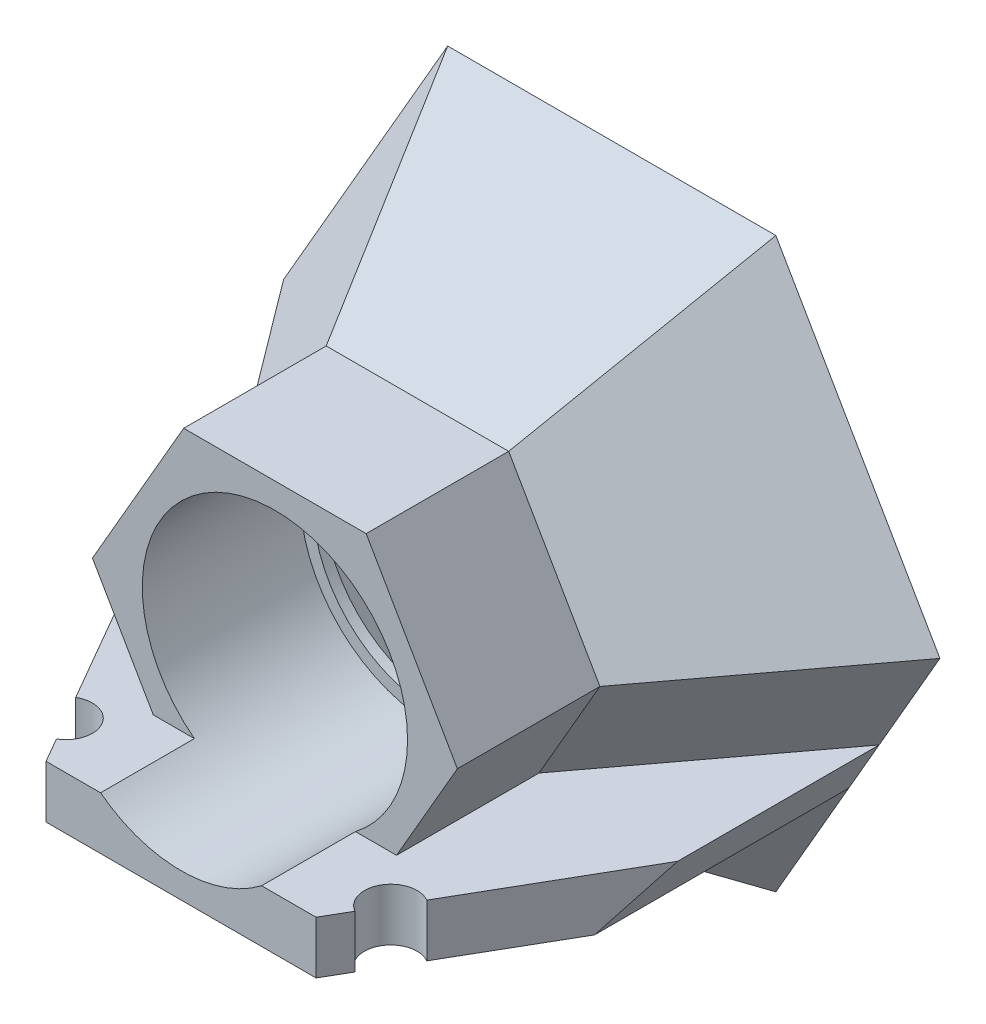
from build123d import *

# Parameters (mm, degrees)
EXTRUSION1_DEPTH             = 10
EXTRUSION1_TAPER             = 33
COQUE1_T                     = -2
ESQUISSE3_R                  = 6.3
ENL_V_MAT_EXTRU_1_DEPTH      = 1.5
ESQUISSE4_R                  = 5.7
ENL_V_MAT_EXTRU_2_DEPTH      = 23.304708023
ESQUISSE5_R                  = 6.3
EXTRUSION2_DEPTH             = 6
EXTRUSION2_DIRECTION_2_REACH = 24.918
CONG_1_R                     = 2.5
EXTRUSION3_REACH             = 28.101
EXTRUSION4_DEPTH             = 5
EXTRUSION4_DEPTH_BACK        = 6.769932
ENL_V_MAT_EXTRU_4_DEPTH      = 10
ESQUISSE10_W                 = 23.913300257
ESQUISSE10_H                 = 0.542651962
ENL_V_MAT_EXTRU_5_DEPTH      = 10
ESQUISSE12_R                 = 1.25
ENL_V_MAT_EXTRU_6_DEPTH      = 10
ENL_V_MAT_EXTRU_7_DEPTH      = 10
ENL_V_MAT_EXTRU_8_DEPTH      = 10


with BuildPart() as part:
    # Esquisse1 → Extrusion1 (new body)
    with BuildSketch(Plane.XY):
        Polygon((7.794228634, 13.5), (-7.794228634, 13.5), (-15.588457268, 0), (-7.794228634, -13.5), (7.794228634, -13.5), (15.588457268, 0), align=None)
    extrude(amount=EXTRUSION1_DEPTH, taper=EXTRUSION1_TAPER)

    # Coque1
    coque1_openings = [part.faces().sort_by_distance(p)[0] for p in [
        (0, 0, 0),
    ]]
    offset(amount=COQUE1_T, openings=coque1_openings, kind=Kind.INTERSECTION)

    # Esquisse3 → Enl_v. mat.-Extru.1 (cut)
    with BuildSketch(Plane.XY.offset(10)):
        Circle(ESQUISSE3_R)
    extrude(amount=-ENL_V_MAT_EXTRU_1_DEPTH, mode=Mode.SUBTRACT)

    # Esquisse4 → Enl_v. mat.-Extru.2 (cut, through all)
    with BuildSketch(Plane.XY.offset(8.5)):
        Circle(ESQUISSE4_R)
    extrude(amount=-ENL_V_MAT_EXTRU_2_DEPTH, mode=Mode.SUBTRACT)

    # Esquisse5 → Extrusion2 (add)
    with BuildSketch(Plane.XY.offset(10)):
        Polygon((8.667094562, 0), (4.333547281, 7.505924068), (-4.333547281, 7.505924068), (-8.667094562, 0), (-4.333547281, -7.505924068), (4.333547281, -7.505924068), align=None)
        Circle(ESQUISSE5_R, mode=Mode.SUBTRACT)
    extrude(amount=EXTRUSION2_DEPTH)

    # Esquisse5 → Extrusion2 direction 2 (add, up to next)
    with BuildSketch(Plane.XY.offset(10), mode=Mode.PRIVATE) as extrusion2_direction_2_sk1:
        Polygon((8.667094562, 0), (4.333547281, 7.505924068), (-4.333547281, 7.505924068), (-8.667094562, 0), (-4.333547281, -7.505924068), (4.333547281, -7.505924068), align=None)
        Circle(ESQUISSE5_R, mode=Mode.SUBTRACT)
    extrusion2_direction_2_tool1 = extrude(extrusion2_direction_2_sk1.sketch, amount=-EXTRUSION2_DIRECTION_2_REACH, mode=Mode.PRIVATE) - part.part
    add(extrusion2_direction_2_tool1.solids().sort_by_distance((6.301733, 3.638307, 10))[0])

    # Cong_1
    cong_1_edges = [part.edges().sort_by_distance(p)[0] for p in [
        (9.626109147, 5.557636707, 0),
        (0, 11.115273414, 0),
        (-9.626109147, 5.557636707, 0),
        (-9.626109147, -5.557636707, 0),
        (0, -11.115273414, 0),
        (9.626109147, -5.557636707, 0),
    ]]
    fillet(cong_1_edges, radius=CONG_1_R)

    # Esquisse6 → Extrusion3 (add, up to next)
    with BuildSketch(Plane.XY.offset(16), mode=Mode.PRIVATE) as extrusion3_sk1:
        Polygon((4.333547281, -7.505924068), (11.254909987, -7.505924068), (12.69828566, -5.005924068), (5.776922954, -5.005924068), align=None)
    extrusion3_tool1 = extrude(extrusion3_sk1.sketch, amount=-EXTRUSION3_REACH, mode=Mode.PRIVATE) - part.part
    # Esquisse6 → Extrusion3 (add, up to next)
    with BuildSketch(Plane.XY.offset(16), mode=Mode.PRIVATE) as extrusion3_sk2:
        Polygon((-5.776922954, -5.005924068), (-4.333547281, -7.505924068), (-11.254909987, -7.505924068), (-12.69828566, -5.005924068), align=None)
    extrusion3_tool2 = extrude(extrusion3_sk2.sketch, amount=-EXTRUSION3_REACH, mode=Mode.PRIVATE) - part.part
    add(extrusion3_tool1.solids().sort_by_distance((8.515916, -6.255924, 16))[0])
    add(extrusion3_tool2.solids().sort_by_distance((-8.515916, -6.255924, 16))[0])

    # Esquisse7 → Extrusion4 (add, two sides: drawn at the far end of the back side and taken through both)
    with BuildSketch(Plane.XY.offset(16).offset(-EXTRUSION4_DEPTH_BACK)):
        with BuildLine():
            Line((17.5, -5.005924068), (3.825012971, -5.005924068))
            ThreePointArc((3.825012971, -5.005924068), (0, -6.3), (-3.825012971, -5.005924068))
            Line((-3.825012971, -5.005924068), (-17.5, -5.005924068))
            Line((-17.5, -5.005924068), (-17.5, -7.505924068))
            Line((-17.5, -7.505924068), (17.5, -7.505924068))
            Line((17.5, -7.505924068), (17.5, -5.005924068))
        make_face()
    extrude(amount=EXTRUSION4_DEPTH + EXTRUSION4_DEPTH_BACK)

    # Esquisse9 → Enl_v. mat.-Extru.4 (cut)
    with BuildSketch(Plane(origin=(0, -5.005924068, 0), x_dir=(-1, 0, 0), z_dir=(0, 1, 0))):
        Polygon((-12.69828566, 9.571433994), (-6.1, 21), (-20.157063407, 21), (-20.157063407, 6.715322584), (-12.69828566, 9.230067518), align=None)
        Polygon((12.69828566, 9.230067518), (12.69828566, 9.571433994), (6.1, 21), (20.157063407, 21), (20.157063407, 6.715322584), align=None)
    extrude(amount=-ENL_V_MAT_EXTRU_4_DEPTH, mode=Mode.SUBTRACT)

    # Esquisse10 → Enl_v. mat.-Extru.5 (cut)
    with BuildSketch(Plane(origin=(0, -5.005924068, 0), x_dir=(-1, 0, 0), z_dir=(0, 1, 0))):
        with Locations((5.543349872, 20.728674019)):
            Rectangle(ESQUISSE10_W, ESQUISSE10_H)
    extrude(amount=-ENL_V_MAT_EXTRU_5_DEPTH, mode=Mode.SUBTRACT)

    # Esquisse12 → Enl_v. mat.-Extru.6 (cut)
    with BuildSketch(Plane(origin=(0, -5.005924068, 0), x_dir=(-1, 0, 0), z_dir=(0, 1, 0))):
        with Locations((-7.712338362, 18.207348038)):
            Circle(ESQUISSE12_R)
        with Locations((7.712338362, 18.207348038)):
            Circle(ESQUISSE12_R)
    extrude(amount=-ENL_V_MAT_EXTRU_6_DEPTH, mode=Mode.SUBTRACT)

    # Esquisse13 → Enl_v. mat.-Extru.7 (cut)
    with BuildSketch(Plane(origin=(0, 0, 9.230067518), x_dir=(-1, 0, 0), z_dir=(0, 0, -1))):
        Polygon((11.254909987, -7.505924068), (12.69828566, -5.005924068), (14.445369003, -5.005924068), (14.768111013, -9.929861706), align=None)
    extrude(amount=-ENL_V_MAT_EXTRU_7_DEPTH, mode=Mode.SUBTRACT)

    # Esquisse14 → Enl_v. mat.-Extru.8 (cut)
    with BuildSketch(Plane(origin=(0, 0, 9.230067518), x_dir=(-1, 0, 0), z_dir=(0, 0, -1))):
        Polygon((-11.254909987, -7.505924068), (-12.69828566, -5.005924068), (-14.473806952, -5.085801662), (-14.473806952, -8.7065395), align=None)
    extrude(amount=-ENL_V_MAT_EXTRU_8_DEPTH, mode=Mode.SUBTRACT)


solid = part.part
